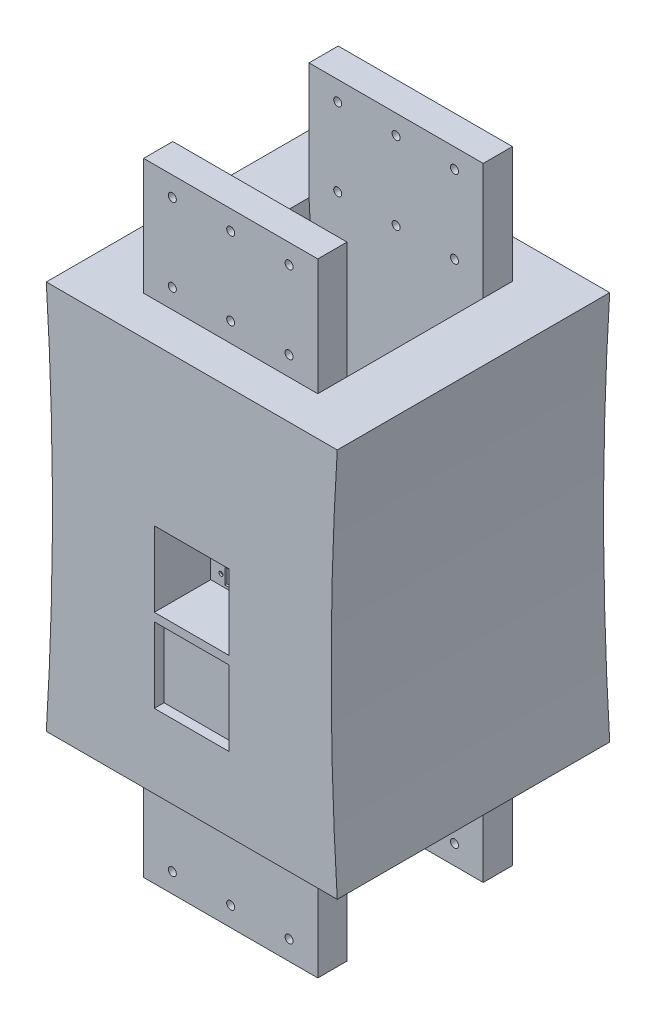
from build123d import *

# Parameters (mm, degrees)
SKETCH_2_W                = 200
SKETCH_2_H                = 113
SKETCH_2_W_2              = 140
SKETCH_2_H_2              = 60
EXTRUDE_2_DEPTH           = 90
SKETCH_4_W                = 200
SKETCH_4_H                = 90
CUT_EXTRUDE_2_DEPTH       = 3
SKETCH_5_R                = 1.5
CUT_EXTRUDE_3_DEPTH       = 222.585198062
SKETCH_6_W                = 200
SKETCH_6_H                = 30
EXTRUDE_4_DEPTH           = 50
EXTRUDE_5_DEPTH           = 140
EXTRUDE_5_2_DEPTH         = 140
CUT_EXTRUDE_4_DEPTH       = 744.370701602
CUT_EXTRUDE_5_DEPTH       = 612.064644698
EXTRUDE_7_DEPTH           = 30
CUT_EXTRUDE_6_DEPTH       = 612.064644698
EXTRUDE_8_DEPTH           = 30
CUT_EXTRUDE_7_DEPTH       = 20
CUT_EXTRUDE_8_DEPTH       = 20
CUT_EXTRUDE_9_DEPTH       = 602.40931708
CUT_EXTRUDE_9_DEPTH_BACK  = 3
SKETCH_17_R               = 5.3
SKETCH_17_R_2             = 2.059176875
SKETCH_19_R               = 2.059176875
CUT_EXTRUDE_10_DEPTH      = 602.40931708
EXTRUDE_9_DEPTH           = 20
CUT_EXTRUDE_11_DEPTH      = 602.40931708
SKETCH_23_R               = 5.3
CUT_EXTRUDE_12_DEPTH      = 3
SKETCH_24_R               = 5.3
CUT_EXTRUDE_13_DEPTH      = 3
SKETCH_25_R               = 5.3
SKETCH_25_R_2             = 2.059176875
EXTRUDE_11_DEPTH          = 3
EXTRUDE_11_2_DEPTH        = 3
EXTRUDE_11_3_DEPTH        = 3
EXTRUDE_11_4_DEPTH        = 3
EXTRUDE_11_5_DEPTH        = 3
EXTRUDE_11_6_DEPTH        = 3
CUT_EXTRUDE_14_DEPTH      = 606.717068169
SKETCH_29_R               = 2.059176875
CUT_EXTRUDE_16_DEPTH      = 20
CUT_EXTRUDE_17_DEPTH      = 605.527066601
CUT_EXTRUDE_17_DEPTH_BACK = 605.527066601
SKETCH_30_R               = 2.059176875
CUT_EXTRUDE_18_DEPTH      = 605.527066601
CUT_EXTRUDE_18_DEPTH_BACK = 20
SKETCH_32_R               = 5.3
CUT_EXTRUDE_19_DEPTH      = 3
SKETCH_33_R               = 5.3
CUT_EXTRUDE_20_DEPTH      = 3
SKETCH_35_W               = 19.25
SKETCH_35_H               = 38.5
CUT_EXTRUDE_21_DEPTH      = 29
SKETCH_36_W               = 38.5
SKETCH_36_H               = 38.5
EXTRUDE_12_DEPTH          = 2
SKETCH_37_R               = 1.05
CUT_EXTRUDE_22_DEPTH      = 3
SKETCH_39_R               = 1.05
CUT_EXTRUDE_23_DEPTH      = 30
SKETCH_40_R               = 5.5
CUT_EXTRUDE_24_DEPTH      = 3
SKETCH_41_R               = 5.5
CUT_EXTRUDE_25_DEPTH      = 3
SKETCH_42_R               = 5.5
CUT_EXTRUDE_26_DEPTH      = 3
SKETCH_43_R               = 5.5
CUT_EXTRUDE_27_DEPTH      = 3
CUT_EXTRUDE_28_DEPTH      = 599.291713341
CUT_EXTRUDE_28_DEPTH_BACK = 599.291713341
CUT_EXTRUDE_29_DEPTH      = 601.210774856
CUT_EXTRUDE_29_DEPTH_BACK = 601.210774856
SKETCH_46_R               = 5.5
SKETCH_46_R_2             = 2.059176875
EXTRUDE_13_DEPTH          = 10
SKETCH_47_R               = 5.5
SKETCH_47_R_2             = 2.059176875
EXTRUDE_14_DEPTH          = 10
EXTRUDE_15_REACH          = 600.292
SKETCH_48_R               = 5.5
SKETCH_48_R_2             = 2.059176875
EXTRUDE_16_REACH          = 600.292
SKETCH_49_R               = 5.5
SKETCH_49_R_2             = 2.059176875
CUT_EXTRUDE_30_DEPTH      = 5
SKETCH_51_R               = 2.059176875
EXTRUDE_17_DEPTH          = 5
SKETCH_52_R               = 2.059176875
EXTRUDE_18_DEPTH          = 5


with BuildPart() as part:
    # Sketch 2 → Extrude 2 (new body)
    with BuildSketch(Plane.XY):
        with Locations((70, 53.5)):
            Rectangle(SKETCH_2_W, SKETCH_2_H)
        with Locations((70, 30)):
            Rectangle(SKETCH_2_W_2, SKETCH_2_H_2, mode=Mode.SUBTRACT)
    extrude(amount=EXTRUDE_2_DEPTH)

    # Sketch 4 → Cut-Extrude 2 (cut)
    with BuildSketch(Plane.XZ.offset(3)):
        with Locations((70, 45)):
            Rectangle(SKETCH_4_W, SKETCH_4_H)
    extrude(amount=-CUT_EXTRUDE_2_DEPTH, mode=Mode.SUBTRACT)

    # Sketch 5 → Cut-Extrude 3 (cut, through all)
    with BuildSketch(Plane(origin=(0, 110, 0), x_dir=(1, 0, 0), z_dir=(0, 1, 0))):
        with Locations(Location((132.5, -7.5, 0), (0, 0, 270))):
            Circle(SKETCH_5_R)
        with Locations(Location((112.5, -7.5, 0), (0, 0, 270))):
            Circle(SKETCH_5_R)
        with Locations(Location((112.5, -17.5, 0), (0, 0, 270))):
            Circle(SKETCH_5_R)
        with Locations(Location((132.5, -17.5, 0), (0, 0, 270))):
            Circle(SKETCH_5_R)
        with Locations(Location((27.5, -7.5, 0), (0, 0, 90))):
            Circle(SKETCH_5_R)
        with Locations(Location((7.5, -7.5, 0), (0, 0, 90))):
            Circle(SKETCH_5_R)
        with Locations(Location((7.5, -17.5, 0), (0, 0, 90))):
            Circle(SKETCH_5_R)
        with Locations(Location((27.5, -17.5, 0), (0, 0, 90))):
            Circle(SKETCH_5_R)
    extrude(amount=-CUT_EXTRUDE_3_DEPTH, mode=Mode.SUBTRACT)

    # Sketch 6 → Extrude 4 (add)
    with BuildSketch(Plane(origin=(0, 0, 0), x_dir=(-1, 0, 0), z_dir=(0, 0, -1))):
        with Locations((-70, 95)):
            Rectangle(SKETCH_6_W, SKETCH_6_H)
    extrude(amount=EXTRUDE_4_DEPTH)

    # Sketch 11 → Cut-Extrude 5 (cut, through all)
    with BuildSketch(Plane.XY.offset(90)):
        Polygon((-30, 110), (-30, 0), (0, 0), (0, 60), (140, 60), (140, 0), (170, 0), (170, 110), align=None)
    extrude(amount=-CUT_EXTRUDE_5_DEPTH, mode=Mode.SUBTRACT)


with BuildPart() as body_2:
    # Sketch 7 → Extrude 5 (new body)
    with BuildSketch(Plane(origin=(0, 0, -50), x_dir=(-1, 0, 0), z_dir=(0, 0, -1))):
        with BuildLine():
            Line((-170, 110), (-140, 110))
            ThreePointArc((-140, 110), (-111.62336455, 410), (-140, 710))
            Line((-140, 710), (-170, 710))
            ThreePointArc((-170, 710), (-141.62336455, 410), (-170, 110))
        make_face()
    extrude(amount=-EXTRUDE_5_DEPTH)


with BuildPart() as body_3:
    # Sketch 7 → Extrude 5 2 (new body)
    with BuildSketch(Plane(origin=(0, 0, -50), x_dir=(-1, 0, 0), z_dir=(0, 0, -1))):
        with BuildLine():
            Line((0, 110), (30, 110))
            ThreePointArc((30, 110), (1.62336455, 410), (30, 710))
            Line((30, 710), (0, 710))
            ThreePointArc((0, 710), (-28.37663545, 410), (0, 110))
        make_face()
    extrude(amount=-EXTRUDE_5_2_DEPTH)


with BuildPart() as cut_extrude_4_tool:
    # Sketch 9 → Cut-Extrude 4 (new, through all)
    with BuildSketch(Plane.XY.offset(90)):
        with BuildLine():
            Line((-9.64346518, 570), (20.35653482, 570))
            ThreePointArc((20.35653482, 570), (11.726376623, 640.225100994), (0, 710))
            Line((0, 710), (-30, 710))
            ThreePointArc((-30, 710), (-18.273623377, 640.225100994), (-9.64346518, 570))
        make_face()
        with BuildLine():
            ThreePointArc((140, 710), (128.273623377, 640.225100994), (119.64346518, 570))
            Line((119.64346518, 570), (149.64346518, 570))
            ThreePointArc((149.64346518, 570), (158.273623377, 640.225100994), (170, 710))
            Line((170, 710), (140, 710))
        make_face()
    extrude(amount=-CUT_EXTRUDE_4_DEPTH)


with BuildPart() as body_2_1:
    add(body_2.part)

    # Cut-Extrude 4: cut by cut_extrude_4_tool
    add(cut_extrude_4_tool.part, mode=Mode.SUBTRACT)



with BuildPart() as body_3_1:
    add(body_3.part)

    # Cut-Extrude 4: cut by cut_extrude_4_tool
    add(cut_extrude_4_tool.part, mode=Mode.SUBTRACT)


with BuildPart() as body_2_2:
    add(body_2_1.part)

    add(body_3_1.part)  # Extrude 7 merges body 3
    # Sketch 12 → Extrude 7 (add)
    with BuildSketch(Plane.XY.offset(90)):
        with BuildLine():
            ThreePointArc((119.64346518, 570), (113.187753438, 339.263890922), (140, 110))
            Line((140, 110), (0, 110))
            ThreePointArc((0, 110), (26.812246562, 339.263890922), (20.35653482, 570))
            Line((20.35653482, 570), (119.64346518, 570))
        make_face()
    extrude(amount=-EXTRUDE_7_DEPTH)

    # Sketch 13 → Cut-Extrude 6 (cut, through all)
    with BuildSketch(Plane.XY.offset(90)):
        with BuildLine():
            Line((25.248577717, 310), (-4.751422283, 310))
            ThreePointArc((-4.751422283, 310), (-14.222776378, 209.601964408), (-30, 110))
            Line((-30, 110), (0, 110))
            ThreePointArc((0, 110), (15.777223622, 209.601964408), (25.248577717, 310))
        make_face()
        with BuildLine():
            ThreePointArc((114.751422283, 310), (124.222776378, 209.601964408), (140, 110))
            Line((140, 110), (170, 110))
            ThreePointArc((170, 110), (154.222776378, 209.601964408), (144.751422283, 310))
            Line((144.751422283, 310), (114.751422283, 310))
        make_face()
    extrude(amount=-CUT_EXTRUDE_6_DEPTH, mode=Mode.SUBTRACT)

    # Sketch 14 → Extrude 8 (add)
    with BuildSketch(Plane(origin=(0, 0, -50), x_dir=(-1, 0, 0), z_dir=(0, 0, -1))):
        with BuildLine():
            ThreePointArc((-20.35653482, 570), (-28.093490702, 440.099551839), (-25.248577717, 310))
            ThreePointArc((-25.248577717, 310), (-15.777223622, 209.601964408), (0, 110))
            Line((0, 110), (-140, 110))
            ThreePointArc((-140, 110), (-124.222776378, 209.601964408), (-114.751422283, 310))
            ThreePointArc((-114.751422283, 310), (-111.906509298, 440.099551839), (-119.64346518, 570))
            Line((-119.64346518, 570), (-20.35653482, 570))
        make_face()
    extrude(amount=-EXTRUDE_8_DEPTH)

    # Sketch 15 → Cut-Extrude 7 (cut)
    with BuildSketch(Plane(origin=(0, 0, -50), x_dir=(-1, 0, 0), z_dir=(0, 0, -1))):
        with BuildLine():
            Line((-114.751422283, 310), (-25.248577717, 310))
            ThreePointArc((-25.248577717, 310), (-15.777223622, 209.601964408), (0, 110))
            Line((0, 110), (-140, 110))
            ThreePointArc((-140, 110), (-124.222776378, 209.601964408), (-114.751422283, 310))
        make_face()
    extrude(amount=-CUT_EXTRUDE_7_DEPTH, mode=Mode.SUBTRACT)

    # Sketch 16 → Cut-Extrude 8 (cut)
    with BuildSketch(Plane.XY.offset(90)):
        with BuildLine():
            Line((0, 110), (140, 110))
            ThreePointArc((140, 110), (124.222776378, 209.601964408), (114.751422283, 310))
            Line((114.751422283, 310), (144.751422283, 310))
            ThreePointArc((144.751422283, 310), (141.906509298, 440.099551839), (149.64346518, 570))
            Line((149.64346518, 570), (-9.64346518, 570))
            ThreePointArc((-9.64346518, 570), (-1.906509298, 440.099551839), (-4.751422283, 310))
            Line((-4.751422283, 310), (25.248577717, 310))
            ThreePointArc((25.248577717, 310), (15.777223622, 209.601964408), (0, 110))
        make_face()
    extrude(amount=-CUT_EXTRUDE_8_DEPTH, mode=Mode.SUBTRACT)

    # Sketch 17 → Cut-Extrude 9 (cut, two sides: drawn at the far end of the back side and taken through both)
    # profile 1 of 6: a face of its own
    with BuildSketch(Plane.XY.offset(70).offset(-CUT_EXTRUDE_9_DEPTH_BACK)):
        with Locations(Location((100, 260, 0), (0, 0, 180))):
            Circle(SKETCH_17_R)
        with Locations(Location((100, 260, 0), (0, 0, 180))):
            Circle(SKETCH_17_R_2, mode=Mode.SUBTRACT)
    # profile 2 of 6: a face of its own
    with BuildSketch(Plane.XY.offset(70).offset(-CUT_EXTRUDE_9_DEPTH_BACK)):
        with Locations(Location((70, 260, 0), (0, 0, 180))):
            Circle(SKETCH_17_R)
        with Locations(Location((70, 260, 0), (0, 0, 180))):
            Circle(SKETCH_17_R_2, mode=Mode.SUBTRACT)
    # profile 3 of 6: a face of its own
    with BuildSketch(Plane.XY.offset(70).offset(-CUT_EXTRUDE_9_DEPTH_BACK)):
        with Locations(Location((40, 260, 0), (0, 0, 180))):
            Circle(SKETCH_17_R)
        with Locations(Location((40, 260, 0), (0, 0, 180))):
            Circle(SKETCH_17_R_2, mode=Mode.SUBTRACT)
    # profile 4 of 6: a face of its own
    with BuildSketch(Plane.XY.offset(70).offset(-CUT_EXTRUDE_9_DEPTH_BACK)):
        with Locations(Location((70, 300, 0), (0, 0, 180))):
            Circle(SKETCH_17_R)
        with Locations(Location((70, 300, 0), (0, 0, 180))):
            Circle(SKETCH_17_R_2, mode=Mode.SUBTRACT)
    # profile 5 of 6: a face of its own
    with BuildSketch(Plane.XY.offset(70).offset(-CUT_EXTRUDE_9_DEPTH_BACK)):
        with Locations(Location((40, 300, 0), (0, 0, 180))):
            Circle(SKETCH_17_R)
        with Locations(Location((40, 300, 0), (0, 0, 180))):
            Circle(SKETCH_17_R_2, mode=Mode.SUBTRACT)
    # profile 6 of 6: a face of its own
    with BuildSketch(Plane.XY.offset(70).offset(-CUT_EXTRUDE_9_DEPTH_BACK)):
        with Locations(Location((100, 300, 0), (0, 0, 180))):
            Circle(SKETCH_17_R)
        with Locations(Location((100, 300, 0), (0, 0, 180))):
            Circle(SKETCH_17_R_2, mode=Mode.SUBTRACT)
    extrude(amount=CUT_EXTRUDE_9_DEPTH + CUT_EXTRUDE_9_DEPTH_BACK, mode=Mode.SUBTRACT)

    # Sketch 19 → Cut-Extrude 10 (cut, through all)
    with BuildSketch(Plane.XY.offset(70)):
        with Locations((40, 300)):
            Circle(SKETCH_19_R)
        with Locations((40, 260)):
            Circle(SKETCH_19_R)
        with Locations((70, 260)):
            Circle(SKETCH_19_R)
        with Locations((70, 300)):
            Circle(SKETCH_19_R)
        with Locations((100, 300)):
            Circle(SKETCH_19_R)
        with Locations((100, 260)):
            Circle(SKETCH_19_R)
    extrude(amount=-CUT_EXTRUDE_10_DEPTH, mode=Mode.SUBTRACT)

    # Sketch 21 → Extrude 9 (add)
    with BuildSketch(Plane.XY.offset(70)):
        with BuildLine():
            Line((25.248577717, 310), (114.751422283, 310))
            Line((114.751422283, 310), (144.751422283, 310))
            ThreePointArc((144.751422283, 310), (141.906509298, 440.099551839), (149.64346518, 570))
            Line((149.64346518, 570), (-9.64346518, 570))
            ThreePointArc((-9.64346518, 570), (-1.906509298, 440.099551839), (-4.751422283, 310))
            Line((-4.751422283, 310), (25.248577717, 310))
        make_face()
    extrude(amount=EXTRUDE_9_DEPTH)

    # Sketch 22 → Cut-Extrude 11 (cut, through all)
    with BuildSketch(Plane(origin=(0, 0, -30), x_dir=(-1, 0, 0), z_dir=(0, 0, -1))):
        with BuildLine():
            Line((-20.35653482, 250), (-76.288101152, 250))
            Line((-76.288101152, 250), (-119.64346518, 250))
            ThreePointArc((-119.64346518, 250), (-128.273623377, 179.774899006), (-140, 110))
            Line((-140, 110), (0, 110))
            ThreePointArc((0, 110), (-11.726376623, 179.774899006), (-20.35653482, 250))
        make_face()
    extrude(amount=-CUT_EXTRUDE_11_DEPTH, mode=Mode.SUBTRACT)

    # Sketch 23 → Cut-Extrude 12 (cut)
    with BuildSketch(Plane.XY.offset(-20)):
        with Locations(Location((70, 300, 0), (0, 0, 180))):
            Circle(SKETCH_23_R)
        with Locations(Location((40, 300, 0), (0, 0, 180))):
            Circle(SKETCH_23_R)
        with Locations(Location((100, 300, 0), (0, 0, 180))):
            Circle(SKETCH_23_R)
        with Locations(Location((40, 260, 0), (0, 0, 180))):
            Circle(SKETCH_23_R)
        with Locations(Location((70, 260, 0), (0, 0, 180))):
            Circle(SKETCH_23_R)
        with Locations(Location((100, 260, 0), (0, 0, 180))):
            Circle(SKETCH_23_R)
    extrude(amount=-CUT_EXTRUDE_12_DEPTH, mode=Mode.SUBTRACT)

    # Sketch 24 → Cut-Extrude 13 (cut)
    with BuildSketch(Plane(origin=(0, 0, 60), x_dir=(-1, 0, 0), z_dir=(0, 0, -1))):
        with Locations((-100, 300)):
            Circle(SKETCH_24_R)
        with Locations((-100, 260)):
            Circle(SKETCH_24_R)
        with Locations((-70, 260)):
            Circle(SKETCH_24_R)
        with Locations((-70, 300)):
            Circle(SKETCH_24_R)
        with Locations((-40, 300)):
            Circle(SKETCH_24_R)
        with Locations((-40, 260)):
            Circle(SKETCH_24_R)
    extrude(amount=-CUT_EXTRUDE_13_DEPTH, mode=Mode.SUBTRACT)

    # Sketch 26 → Cut-Extrude 14 (cut, through all)
    with BuildSketch(Plane.XY.offset(90)):
        with BuildLine():
            Line((-4.751422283, 510), (25.248577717, 510))
            ThreePointArc((25.248577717, 510), (23.084764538, 540.023009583), (20.35653482, 570))
            Line((20.35653482, 570), (-9.64346518, 570))
            ThreePointArc((-9.64346518, 570), (-6.915235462, 540.023009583), (-4.751422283, 510))
        make_face()
        with BuildLine():
            ThreePointArc((119.64346518, 570), (116.915235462, 540.023009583), (114.751422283, 510))
            Line((114.751422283, 510), (144.751422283, 510))
            ThreePointArc((144.751422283, 510), (146.915235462, 540.023009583), (149.64346518, 570))
            Line((149.64346518, 570), (119.64346518, 570))
        make_face()
    extrude(amount=-CUT_EXTRUDE_14_DEPTH, mode=Mode.SUBTRACT)

    # Sketch 29 → Cut-Extrude 16 (cut)
    with BuildSketch(Plane(origin=(0, 0, -50), x_dir=(-1, 0, 0), z_dir=(0, 0, -1))):
        with BuildLine():
            Line((-114.751422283, 510), (-25.248577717, 510))
            ThreePointArc((-25.248577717, 510), (-23.084764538, 540.023009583), (-20.35653482, 570))
            Line((-20.35653482, 570), (-119.64346518, 570))
            ThreePointArc((-119.64346518, 570), (-116.915235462, 540.023009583), (-114.751422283, 510))
        make_face()
        with Locations((-40, 560)):
            Circle(SKETCH_29_R, mode=Mode.SUBTRACT)
        with Locations((-100, 560)):
            Circle(SKETCH_29_R, mode=Mode.SUBTRACT)
        with Locations((-70, 520)):
            Circle(SKETCH_29_R, mode=Mode.SUBTRACT)
        with Locations((-100, 520)):
            Circle(SKETCH_29_R, mode=Mode.SUBTRACT)
        with Locations((-70, 560)):
            Circle(SKETCH_29_R, mode=Mode.SUBTRACT)
        with Locations((-40, 520)):
            Circle(SKETCH_29_R, mode=Mode.SUBTRACT)
    extrude(amount=-CUT_EXTRUDE_16_DEPTH, mode=Mode.SUBTRACT)

    # Sketch 30 → Cut-Extrude 17 (cut, two sides: drawn at the far end of the back side and taken through both)
    with BuildSketch(Plane(origin=(0, 0, -50), x_dir=(-1, 0, 0), z_dir=(0, 0, -1)).offset(-CUT_EXTRUDE_17_DEPTH_BACK)):
        with Locations((-100, 520)):
            Circle(SKETCH_30_R)
        with Locations((-100, 560)):
            Circle(SKETCH_30_R)
        with Locations((-70, 560)):
            Circle(SKETCH_30_R)
        with Locations((-70, 520)):
            Circle(SKETCH_30_R)
        with Locations((-40, 560)):
            Circle(SKETCH_30_R)
        with Locations((-40, 520)):
            Circle(SKETCH_30_R)
    extrude(amount=CUT_EXTRUDE_17_DEPTH + CUT_EXTRUDE_17_DEPTH_BACK, mode=Mode.SUBTRACT)

    # Sketch 31 → Cut-Extrude 18 (cut, two sides: drawn at the far end of the back side and taken through both)
    with BuildSketch(Plane.XY.offset(90).offset(-CUT_EXTRUDE_18_DEPTH_BACK)):
        with BuildLine():
            Line((25.248577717, 510), (114.751422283, 510))
            ThreePointArc((114.751422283, 510), (116.915235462, 540.023009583), (119.64346518, 570))
            Line((119.64346518, 570), (20.35653482, 570))
            ThreePointArc((20.35653482, 570), (23.084764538, 540.023009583), (25.248577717, 510))
        make_face()
    extrude(amount=CUT_EXTRUDE_18_DEPTH + CUT_EXTRUDE_18_DEPTH_BACK, mode=Mode.SUBTRACT)

    # Sketch 32 → Cut-Extrude 19 (cut)
    with BuildSketch(Plane.XY.offset(-20)):
        with Locations((40, 300)):
            Circle(SKETCH_32_R)
        with Locations(Location((70, 260, 0), (0, 0, 180))):
            Circle(SKETCH_32_R)
        with Locations(Location((100, 260, 0), (0, 0, 180))):
            Circle(SKETCH_32_R)
        with Locations(Location((100, 300, 0), (0, 0, 180))):
            Circle(SKETCH_32_R)
        with Locations(Location((70, 300, 0), (0, 0, 180))):
            Circle(SKETCH_32_R)
        with Locations(Location((40, 260, 0), (0, 0, 180))):
            Circle(SKETCH_32_R)
        with Locations(Location((100, 560, 0), (0, 0, 180))):
            Circle(SKETCH_32_R)
        with Locations(Location((70, 560, 0), (0, 0, 180))):
            Circle(SKETCH_32_R)
        with Locations(Location((40, 560, 0), (0, 0, 180))):
            Circle(SKETCH_32_R)
        with Locations(Location((40, 520, 0), (0, 0, 180))):
            Circle(SKETCH_32_R)
        with Locations(Location((100, 520, 0), (0, 0, 180))):
            Circle(SKETCH_32_R)
        with Locations(Location((70, 520, 0), (0, 0, 180))):
            Circle(SKETCH_32_R)
    extrude(amount=-CUT_EXTRUDE_19_DEPTH, mode=Mode.SUBTRACT)

    # Sketch 33 → Cut-Extrude 20 (cut)
    with BuildSketch(Plane(origin=(0, 0, 60), x_dir=(-1, 0, 0), z_dir=(0, 0, -1))):
        with Locations((-100, 560)):
            Circle(SKETCH_33_R)
        with Locations((-100, 520)):
            Circle(SKETCH_33_R)
        with Locations((-70, 520)):
            Circle(SKETCH_33_R)
        with Locations((-40, 520)):
            Circle(SKETCH_33_R)
        with Locations((-40, 560)):
            Circle(SKETCH_33_R)
        with Locations((-70, 560)):
            Circle(SKETCH_33_R)
    extrude(amount=-CUT_EXTRUDE_20_DEPTH, mode=Mode.SUBTRACT)

    # Sketch 35 → Cut-Extrude 21 (cut)
    with BuildSketch(Plane.XY.offset(90)):
        with Locations((60.375, 410)):
            Rectangle(SKETCH_35_W, SKETCH_35_H)
        with Locations((79.625, 410)):
            Rectangle(SKETCH_35_W, SKETCH_35_H)
    extrude(amount=-CUT_EXTRUDE_21_DEPTH, mode=Mode.SUBTRACT)

    # Sketch 36 → Extrude 12 (add)
    with BuildSketch(Plane.XY.offset(61)):
        with Locations((70, 410)):
            Rectangle(SKETCH_36_W, SKETCH_36_H)
    extrude(amount=-EXTRUDE_12_DEPTH)

    # Sketch 37 → Cut-Extrude 22 (cut)
    with BuildSketch(Plane.XY.offset(61)):
        with Locations((84, 424)):
            Circle(SKETCH_37_R)
        with Locations((84, 396)):
            Circle(SKETCH_37_R)
        with Locations((56, 396)):
            Circle(SKETCH_37_R)
        with Locations((56, 424)):
            Circle(SKETCH_37_R)
    extrude(amount=-CUT_EXTRUDE_22_DEPTH, mode=Mode.SUBTRACT)

    # Sketch 39 → Cut-Extrude 23 (cut)
    with BuildSketch(Plane.XY.offset(61)):
        Polygon((58, 400), (70, 400), (70, 392), (58, 392), (58, 396), align=None)
        Polygon((70, 392), (82, 392), (82, 396), (82, 400), (70, 400), align=None)
        Polygon((58, 420), (70, 420), (70, 428), (58, 428), (58, 424), align=None)
        Polygon((82, 420), (82, 424), (82, 428), (70, 428), (70, 420), align=None)
        with Locations((56, 424)):
            Circle(SKETCH_39_R)
        with Locations((56, 396)):
            Circle(SKETCH_39_R)
        with Locations((84, 396)):
            Circle(SKETCH_39_R)
        with Locations((84, 424)):
            Circle(SKETCH_39_R)
    extrude(amount=-CUT_EXTRUDE_23_DEPTH, mode=Mode.SUBTRACT)

    # Sketch 40 → Cut-Extrude 24 (cut)
    with BuildSketch(Plane(origin=(0, 0, 60), x_dir=(-1, 0, 0), z_dir=(0, 0, -1))):
        with Locations((-100, 560)):
            Circle(SKETCH_40_R)
        with Locations((-70, 560)):
            Circle(SKETCH_40_R)
        with Locations((-40, 560)):
            Circle(SKETCH_40_R)
        with Locations((-70, 520)):
            Circle(SKETCH_40_R)
        with Locations((-40, 520)):
            Circle(SKETCH_40_R)
        with Locations((-100, 520)):
            Circle(SKETCH_40_R)
    extrude(amount=-CUT_EXTRUDE_24_DEPTH, mode=Mode.SUBTRACT)

    # Sketch 41 → Cut-Extrude 25 (cut)
    with BuildSketch(Plane.XY.offset(-20)):
        with Locations(Location((100, 560, 0), (0, 0, 180))):
            Circle(SKETCH_41_R)
        with Locations(Location((40, 560, 0), (0, 0, 180))):
            Circle(SKETCH_41_R)
        with Locations(Location((70, 560, 0), (0, 0, 180))):
            Circle(SKETCH_41_R)
        with Locations(Location((40, 520, 0), (0, 0, 180))):
            Circle(SKETCH_41_R)
        with Locations(Location((70, 520, 0), (0, 0, 180))):
            Circle(SKETCH_41_R)
        with Locations(Location((100, 520, 0), (0, 0, 180))):
            Circle(SKETCH_41_R)
    extrude(amount=-CUT_EXTRUDE_25_DEPTH, mode=Mode.SUBTRACT)

    # Sketch 42 → Cut-Extrude 26 (cut)
    with BuildSketch(Plane(origin=(0, 0, 60), x_dir=(-1, 0, 0), z_dir=(0, 0, -1))):
        with Locations(Location((-40, 300, 0), (0, 0, 180))):
            Circle(SKETCH_42_R)
        with Locations(Location((-70, 300, 0), (0, 0, 180))):
            Circle(SKETCH_42_R)
        with Locations(Location((-100, 300, 0), (0, 0, 180))):
            Circle(SKETCH_42_R)
        with Locations(Location((-100, 260, 0), (0, 0, 180))):
            Circle(SKETCH_42_R)
        with Locations(Location((-70, 260, 0), (0, 0, 180))):
            Circle(SKETCH_42_R)
        with Locations(Location((-40, 260, 0), (0, 0, 180))):
            Circle(SKETCH_42_R)
    extrude(amount=-CUT_EXTRUDE_26_DEPTH, mode=Mode.SUBTRACT)

    # Sketch 43 → Cut-Extrude 27 (cut)
    with BuildSketch(Plane.XY.offset(-20)):
        with Locations((100, 300)):
            Circle(SKETCH_43_R)
        with Locations((100, 260)):
            Circle(SKETCH_43_R)
        with Locations((70, 260)):
            Circle(SKETCH_43_R)
        with Locations((40, 260)):
            Circle(SKETCH_43_R)
        with Locations((40, 300)):
            Circle(SKETCH_43_R)
        with Locations((70, 300)):
            Circle(SKETCH_43_R)
    extrude(amount=-CUT_EXTRUDE_27_DEPTH, mode=Mode.SUBTRACT)

    # Sketch 44 → Cut-Extrude 28 (cut, two sides: drawn at the far end of the back side and taken through both)
    with BuildSketch(Plane.XY.offset(-20).offset(-CUT_EXTRUDE_28_DEPTH_BACK)):
        with BuildLine():
            ThreePointArc((20.35653482, 570), (23.084764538, 540.023009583), (25.248577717, 510))
            Line((25.248577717, 510), (25.248577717, 570))
            Line((25.248577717, 570), (20.35653482, 570))
        make_face()
        with BuildLine():
            Line((119.64346518, 570), (114.751422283, 570))
            Line((114.751422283, 570), (114.751422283, 510))
            ThreePointArc((114.751422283, 510), (116.915235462, 540.023009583), (119.64346518, 570))
        make_face()
    extrude(amount=CUT_EXTRUDE_28_DEPTH + CUT_EXTRUDE_28_DEPTH_BACK, mode=Mode.SUBTRACT)

    # Sketch 45 → Cut-Extrude 29 (cut, two sides: drawn at the far end of the back side and taken through both)
    with BuildSketch(Plane.XY.offset(70).offset(-CUT_EXTRUDE_29_DEPTH_BACK)):
        with BuildLine():
            Line((25.248577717, 250), (25.248577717, 310))
            ThreePointArc((25.248577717, 310), (23.084764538, 279.976990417), (20.35653482, 250))
            Line((20.35653482, 250), (25.248577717, 250))
        make_face()
        with BuildLine():
            ThreePointArc((119.64346518, 250), (116.915235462, 279.976990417), (114.751422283, 310))
            Line((114.751422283, 310), (114.751422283, 250))
            Line((114.751422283, 250), (119.64346518, 250))
        make_face()
    extrude(amount=CUT_EXTRUDE_29_DEPTH + CUT_EXTRUDE_29_DEPTH_BACK, mode=Mode.SUBTRACT)



with BuildPart() as body_2_2_1:
    # Sketch 25 → Extrude 11 (new body)
    with BuildSketch(Plane.XY.offset(70)):
        with Locations((40, 300)):
            Circle(SKETCH_25_R)
        with Locations((40, 300)):
            Circle(SKETCH_25_R_2, mode=Mode.SUBTRACT)
    extrude(amount=-EXTRUDE_11_DEPTH)


with BuildPart() as body_3_2:
    # Sketch 25 → Extrude 11 2 (new body)
    with BuildSketch(Plane.XY.offset(70)):
        with Locations(Location((70, 300, 0), (0, 0, 180))):
            Circle(SKETCH_25_R)
        with Locations((70, 300)):
            Circle(SKETCH_25_R_2, mode=Mode.SUBTRACT)
    extrude(amount=-EXTRUDE_11_2_DEPTH)


with BuildPart() as body_4:
    # Sketch 25 → Extrude 11 3 (new body)
    with BuildSketch(Plane.XY.offset(70)):
        with Locations(Location((100, 300, 0), (0, 0, 180))):
            Circle(SKETCH_25_R)
        with Locations((100, 300)):
            Circle(SKETCH_25_R_2, mode=Mode.SUBTRACT)
    extrude(amount=-EXTRUDE_11_3_DEPTH)


with BuildPart() as body_5:
    # Sketch 25 → Extrude 11 4 (new body)
    with BuildSketch(Plane.XY.offset(70)):
        with Locations(Location((40, 260, 0), (0, 0, 180))):
            Circle(SKETCH_25_R)
        with Locations((40, 260)):
            Circle(SKETCH_25_R_2, mode=Mode.SUBTRACT)
    extrude(amount=-EXTRUDE_11_4_DEPTH)


with BuildPart() as body_6:
    # Sketch 25 → Extrude 11 5 (new body)
    with BuildSketch(Plane.XY.offset(70)):
        with Locations(Location((70, 260, 0), (0, 0, 180))):
            Circle(SKETCH_25_R)
        with Locations((70, 260)):
            Circle(SKETCH_25_R_2, mode=Mode.SUBTRACT)
    extrude(amount=-EXTRUDE_11_5_DEPTH)


with BuildPart() as body_7:
    # Sketch 25 → Extrude 11 6 (new body)
    with BuildSketch(Plane.XY.offset(70)):
        with Locations(Location((100, 260, 0), (0, 0, 180))):
            Circle(SKETCH_25_R)
        with Locations((100, 260)):
            Circle(SKETCH_25_R_2, mode=Mode.SUBTRACT)
    extrude(amount=-EXTRUDE_11_6_DEPTH)


with BuildPart() as body_2_3:
    add(body_2_2.part)

    add(body_2_2_1.part)  # Extrude 13 merges body 2 2

    add(body_3_2.part)  # Extrude 13 merges body 3 2

    add(body_4.part)  # Extrude 13 merges body 4

    add(body_5.part)  # Extrude 13 merges body 5

    add(body_6.part)  # Extrude 13 merges body 6

    add(body_7.part)  # Extrude 13 merges body 7
    # Sketch 46 → Extrude 13 (add)
    # profile 1 of 6: a face of its own
    with BuildSketch(Plane(origin=(0, 0, 60), x_dir=(-1, 0, 0), z_dir=(0, 0, -1))):
        with Locations((-100, 300)):
            Circle(SKETCH_46_R)
        with Locations(Location((-100, 300, 0), (0, 0, 180))):
            Circle(SKETCH_46_R_2, mode=Mode.SUBTRACT)
    # profile 2 of 6: a face of its own
    with BuildSketch(Plane(origin=(0, 0, 60), x_dir=(-1, 0, 0), z_dir=(0, 0, -1))):
        with Locations((-100, 260)):
            Circle(SKETCH_46_R)
        with Locations(Location((-100, 260, 0), (0, 0, 180))):
            Circle(SKETCH_46_R_2, mode=Mode.SUBTRACT)
    # profile 3 of 6: a face of its own
    with BuildSketch(Plane(origin=(0, 0, 60), x_dir=(-1, 0, 0), z_dir=(0, 0, -1))):
        with Locations((-70, 300)):
            Circle(SKETCH_46_R)
        with Locations(Location((-70, 300, 0), (0, 0, 180))):
            Circle(SKETCH_46_R_2, mode=Mode.SUBTRACT)
    # profile 4 of 6: a face of its own
    with BuildSketch(Plane(origin=(0, 0, 60), x_dir=(-1, 0, 0), z_dir=(0, 0, -1))):
        with Locations((-70, 260)):
            Circle(SKETCH_46_R)
        with Locations(Location((-70, 260, 0), (0, 0, 180))):
            Circle(SKETCH_46_R_2, mode=Mode.SUBTRACT)
    # profile 5 of 6: a face of its own
    with BuildSketch(Plane(origin=(0, 0, 60), x_dir=(-1, 0, 0), z_dir=(0, 0, -1))):
        with Locations((-40, 300)):
            Circle(SKETCH_46_R)
        with Locations(Location((-40, 300, 0), (0, 0, 180))):
            Circle(SKETCH_46_R_2, mode=Mode.SUBTRACT)
    # profile 6 of 6: a face of its own
    with BuildSketch(Plane(origin=(0, 0, 60), x_dir=(-1, 0, 0), z_dir=(0, 0, -1))):
        with Locations((-40, 260)):
            Circle(SKETCH_46_R)
        with Locations(Location((-40, 260, 0), (0, 0, 180))):
            Circle(SKETCH_46_R_2, mode=Mode.SUBTRACT)
    extrude(amount=-EXTRUDE_13_DEPTH)

    # Sketch 47 → Extrude 14 (add)
    # profile 1 of 6: a face of its own
    with BuildSketch(Plane.XY.offset(-20)):
        with Locations((100, 260)):
            Circle(SKETCH_47_R)
        with Locations((100, 260)):
            Circle(SKETCH_47_R_2, mode=Mode.SUBTRACT)
    # profile 2 of 6: a face of its own
    with BuildSketch(Plane.XY.offset(-20)):
        with Locations((70, 260)):
            Circle(SKETCH_47_R)
        with Locations((70, 260)):
            Circle(SKETCH_47_R_2, mode=Mode.SUBTRACT)
    # profile 3 of 6: a face of its own
    with BuildSketch(Plane.XY.offset(-20)):
        with Locations((40, 260)):
            Circle(SKETCH_47_R)
        with Locations((40, 260)):
            Circle(SKETCH_47_R_2, mode=Mode.SUBTRACT)
    # profile 4 of 6: a face of its own
    with BuildSketch(Plane.XY.offset(-20)):
        with Locations((100, 300)):
            Circle(SKETCH_47_R)
        with Locations((100, 300)):
            Circle(SKETCH_47_R_2, mode=Mode.SUBTRACT)
    # profile 5 of 6: a face of its own
    with BuildSketch(Plane.XY.offset(-20)):
        with Locations((40, 300)):
            Circle(SKETCH_47_R)
        with Locations((40, 300)):
            Circle(SKETCH_47_R_2, mode=Mode.SUBTRACT)
    # profile 6 of 6: a face of its own
    with BuildSketch(Plane.XY.offset(-20)):
        with Locations((70, 300)):
            Circle(SKETCH_47_R)
        with Locations((70, 300)):
            Circle(SKETCH_47_R_2, mode=Mode.SUBTRACT)
    extrude(amount=-EXTRUDE_14_DEPTH)

    # Sketch 48 → Extrude 15 (add, up to next)
    with BuildSketch(Plane.XY.offset(-20), mode=Mode.PRIVATE) as extrude_15_sk1:
        with Locations(Location((40, 560, 0), (0, 0, 180))):
            Circle(SKETCH_48_R)
        with Locations(Location((40, 560, 0), (0, 0, 180))):
            Circle(SKETCH_48_R_2, mode=Mode.SUBTRACT)
    extrude_15_tool1 = extrude(extrude_15_sk1.sketch, amount=-EXTRUDE_15_REACH, mode=Mode.PRIVATE) - body_2_3.part
    # Sketch 48 → Extrude 15 (add, up to next)
    with BuildSketch(Plane.XY.offset(-20), mode=Mode.PRIVATE) as extrude_15_sk2:
        with Locations(Location((70, 560, 0), (0, 0, 180))):
            Circle(SKETCH_48_R)
        with Locations(Location((70, 560, 0), (0, 0, 180))):
            Circle(SKETCH_48_R_2, mode=Mode.SUBTRACT)
    extrude_15_tool2 = extrude(extrude_15_sk2.sketch, amount=-EXTRUDE_15_REACH, mode=Mode.PRIVATE) - body_2_3.part
    # Sketch 48 → Extrude 15 (add, up to next)
    with BuildSketch(Plane.XY.offset(-20), mode=Mode.PRIVATE) as extrude_15_sk3:
        with Locations(Location((100, 560, 0), (0, 0, 180))):
            Circle(SKETCH_48_R)
        with Locations(Location((100, 560, 0), (0, 0, 180))):
            Circle(SKETCH_48_R_2, mode=Mode.SUBTRACT)
    extrude_15_tool3 = extrude(extrude_15_sk3.sketch, amount=-EXTRUDE_15_REACH, mode=Mode.PRIVATE) - body_2_3.part
    # Sketch 48 → Extrude 15 (add, up to next)
    with BuildSketch(Plane.XY.offset(-20), mode=Mode.PRIVATE) as extrude_15_sk4:
        with Locations(Location((40, 520, 0), (0, 0, 180))):
            Circle(SKETCH_48_R)
        with Locations(Location((40, 520, 0), (0, 0, 180))):
            Circle(SKETCH_48_R_2, mode=Mode.SUBTRACT)
    extrude_15_tool4 = extrude(extrude_15_sk4.sketch, amount=-EXTRUDE_15_REACH, mode=Mode.PRIVATE) - body_2_3.part
    # Sketch 48 → Extrude 15 (add, up to next)
    with BuildSketch(Plane.XY.offset(-20), mode=Mode.PRIVATE) as extrude_15_sk5:
        with Locations(Location((70, 520, 0), (0, 0, 180))):
            Circle(SKETCH_48_R)
        with Locations(Location((70, 520, 0), (0, 0, 180))):
            Circle(SKETCH_48_R_2, mode=Mode.SUBTRACT)
    extrude_15_tool5 = extrude(extrude_15_sk5.sketch, amount=-EXTRUDE_15_REACH, mode=Mode.PRIVATE) - body_2_3.part
    # Sketch 48 → Extrude 15 (add, up to next)
    with BuildSketch(Plane.XY.offset(-20), mode=Mode.PRIVATE) as extrude_15_sk6:
        with Locations(Location((100, 520, 0), (0, 0, 180))):
            Circle(SKETCH_48_R)
        with Locations(Location((100, 520, 0), (0, 0, 180))):
            Circle(SKETCH_48_R_2, mode=Mode.SUBTRACT)
    extrude_15_tool6 = extrude(extrude_15_sk6.sketch, amount=-EXTRUDE_15_REACH, mode=Mode.PRIVATE) - body_2_3.part
    add(extrude_15_tool1.solids().sort_by_distance((45.344437, 560, -20))[0])
    add(extrude_15_tool2.solids().sort_by_distance((75.344437, 560, -20))[0])
    add(extrude_15_tool3.solids().sort_by_distance((105.344437, 560, -20))[0])
    add(extrude_15_tool4.solids().sort_by_distance((45.344437, 520, -20))[0])
    add(extrude_15_tool5.solids().sort_by_distance((75.344437, 520, -20))[0])
    add(extrude_15_tool6.solids().sort_by_distance((105.344437, 520, -20))[0])

    # Sketch 49 → Extrude 16 (add, up to next)
    with BuildSketch(Plane(origin=(0, 0, 60), x_dir=(-1, 0, 0), z_dir=(0, 0, -1)), mode=Mode.PRIVATE) as extrude_16_sk1:
        with Locations((-100, 560)):
            Circle(SKETCH_49_R)
        with Locations((-100, 560)):
            Circle(SKETCH_49_R_2, mode=Mode.SUBTRACT)
    extrude_16_tool1 = extrude(extrude_16_sk1.sketch, amount=-EXTRUDE_16_REACH, mode=Mode.PRIVATE) - body_2_3.part
    # Sketch 49 → Extrude 16 (add, up to next)
    with BuildSketch(Plane(origin=(0, 0, 60), x_dir=(-1, 0, 0), z_dir=(0, 0, -1)), mode=Mode.PRIVATE) as extrude_16_sk2:
        with Locations((-40, 520)):
            Circle(SKETCH_49_R)
        with Locations((-40, 520)):
            Circle(SKETCH_49_R_2, mode=Mode.SUBTRACT)
    extrude_16_tool2 = extrude(extrude_16_sk2.sketch, amount=-EXTRUDE_16_REACH, mode=Mode.PRIVATE) - body_2_3.part
    # Sketch 49 → Extrude 16 (add, up to next)
    with BuildSketch(Plane(origin=(0, 0, 60), x_dir=(-1, 0, 0), z_dir=(0, 0, -1)), mode=Mode.PRIVATE) as extrude_16_sk3:
        with Locations((-70, 520)):
            Circle(SKETCH_49_R)
        with Locations((-70, 520)):
            Circle(SKETCH_49_R_2, mode=Mode.SUBTRACT)
    extrude_16_tool3 = extrude(extrude_16_sk3.sketch, amount=-EXTRUDE_16_REACH, mode=Mode.PRIVATE) - body_2_3.part
    # Sketch 49 → Extrude 16 (add, up to next)
    with BuildSketch(Plane(origin=(0, 0, 60), x_dir=(-1, 0, 0), z_dir=(0, 0, -1)), mode=Mode.PRIVATE) as extrude_16_sk4:
        with Locations((-100, 520)):
            Circle(SKETCH_49_R)
        with Locations((-100, 520)):
            Circle(SKETCH_49_R_2, mode=Mode.SUBTRACT)
    extrude_16_tool4 = extrude(extrude_16_sk4.sketch, amount=-EXTRUDE_16_REACH, mode=Mode.PRIVATE) - body_2_3.part
    # Sketch 49 → Extrude 16 (add, up to next)
    with BuildSketch(Plane(origin=(0, 0, 60), x_dir=(-1, 0, 0), z_dir=(0, 0, -1)), mode=Mode.PRIVATE) as extrude_16_sk5:
        with Locations((-40, 560)):
            Circle(SKETCH_49_R)
        with Locations((-40, 560)):
            Circle(SKETCH_49_R_2, mode=Mode.SUBTRACT)
    extrude_16_tool5 = extrude(extrude_16_sk5.sketch, amount=-EXTRUDE_16_REACH, mode=Mode.PRIVATE) - body_2_3.part
    # Sketch 49 → Extrude 16 (add, up to next)
    with BuildSketch(Plane(origin=(0, 0, 60), x_dir=(-1, 0, 0), z_dir=(0, 0, -1)), mode=Mode.PRIVATE) as extrude_16_sk6:
        with Locations((-70, 560)):
            Circle(SKETCH_49_R)
        with Locations((-70, 560)):
            Circle(SKETCH_49_R_2, mode=Mode.SUBTRACT)
    extrude_16_tool6 = extrude(extrude_16_sk6.sketch, amount=-EXTRUDE_16_REACH, mode=Mode.PRIVATE) - body_2_3.part
    add(extrude_16_tool1.solids().sort_by_distance((105.344437, 560, 60))[0])
    add(extrude_16_tool2.solids().sort_by_distance((45.344437, 520, 60))[0])
    add(extrude_16_tool3.solids().sort_by_distance((75.344437, 520, 60))[0])
    add(extrude_16_tool4.solids().sort_by_distance((105.344437, 520, 60))[0])
    add(extrude_16_tool5.solids().sort_by_distance((45.344437, 560, 60))[0])
    add(extrude_16_tool6.solids().sort_by_distance((75.344437, 560, 60))[0])

    # Sketch 50 → Cut-Extrude 30 (cut)
    with BuildSketch(Plane.XY.offset(90)):
        Polygon((89.25, 386.5), (89.25, 348), (70, 348), (50.75, 348), (50.75, 386.5), align=None)
    extrude(amount=-CUT_EXTRUDE_30_DEPTH, mode=Mode.SUBTRACT)

    # Sketch 51 → Extrude 17 (add)
    with BuildSketch(Plane(origin=(0, 0, 60), x_dir=(-1, 0, 0), z_dir=(0, 0, -1))):
        with BuildLine():
            Line((-25.248577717, 250), (-25.248577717, 310))
            ThreePointArc((-25.248577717, 310), (-28.37663545, 410), (-25.248577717, 510))
            Line((-25.248577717, 510), (-25.248577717, 570))
            Line((-25.248577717, 570), (-114.751422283, 570))
            Line((-114.751422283, 570), (-114.751422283, 510))
            ThreePointArc((-114.751422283, 510), (-111.62336455, 410), (-114.751422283, 310))
            Line((-114.751422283, 310), (-114.751422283, 250))
            Line((-114.751422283, 250), (-25.248577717, 250))
        make_face()
        with Locations(Location((-40, 260, 0), (0, 0, 180))):
            Circle(SKETCH_51_R, mode=Mode.SUBTRACT)
        with Locations(Location((-40, 300, 0), (0, 0, 180))):
            Circle(SKETCH_51_R, mode=Mode.SUBTRACT)
        with Locations(Location((-70, 300, 0), (0, 0, 180))):
            Circle(SKETCH_51_R, mode=Mode.SUBTRACT)
        with Locations(Location((-70, 260, 0), (0, 0, 180))):
            Circle(SKETCH_51_R, mode=Mode.SUBTRACT)
        with Locations(Location((-100, 260, 0), (0, 0, 180))):
            Circle(SKETCH_51_R, mode=Mode.SUBTRACT)
        with Locations(Location((-100, 300, 0), (0, 0, 180))):
            Circle(SKETCH_51_R, mode=Mode.SUBTRACT)
        with Locations((-40, 520)):
            Circle(SKETCH_51_R, mode=Mode.SUBTRACT)
        with Locations((-70, 520)):
            Circle(SKETCH_51_R, mode=Mode.SUBTRACT)
        with Locations((-100, 520)):
            Circle(SKETCH_51_R, mode=Mode.SUBTRACT)
        with Locations((-100, 560)):
            Circle(SKETCH_51_R, mode=Mode.SUBTRACT)
        with Locations((-70, 560)):
            Circle(SKETCH_51_R, mode=Mode.SUBTRACT)
        with Locations((-40, 560)):
            Circle(SKETCH_51_R, mode=Mode.SUBTRACT)
    extrude(amount=EXTRUDE_17_DEPTH)

    # Sketch 52 → Extrude 18 (add)
    with BuildSketch(Plane.XY.offset(-20)):
        with BuildLine():
            Line((25.248577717, 310), (25.248577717, 250))
            Line((25.248577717, 250), (114.751422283, 250))
            Line((114.751422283, 250), (114.751422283, 310))
            ThreePointArc((114.751422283, 310), (111.62336455, 410), (114.751422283, 510))
            Line((114.751422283, 510), (114.751422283, 570))
            Line((114.751422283, 570), (25.248577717, 570))
            Line((25.248577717, 570), (25.248577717, 510))
            ThreePointArc((25.248577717, 510), (28.37663545, 410), (25.248577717, 310))
        make_face()
        with Locations((100, 260)):
            Circle(SKETCH_52_R, mode=Mode.SUBTRACT)
        with Locations((100, 300)):
            Circle(SKETCH_52_R, mode=Mode.SUBTRACT)
        with Locations((70, 300)):
            Circle(SKETCH_52_R, mode=Mode.SUBTRACT)
        with Locations((70, 260)):
            Circle(SKETCH_52_R, mode=Mode.SUBTRACT)
        with Locations((40, 260)):
            Circle(SKETCH_52_R, mode=Mode.SUBTRACT)
        with Locations((40, 300)):
            Circle(SKETCH_52_R, mode=Mode.SUBTRACT)
        with Locations(Location((40, 520, 0), (0, 0, 180))):
            Circle(SKETCH_52_R, mode=Mode.SUBTRACT)
        with Locations(Location((70, 520, 0), (0, 0, 180))):
            Circle(SKETCH_52_R, mode=Mode.SUBTRACT)
        with Locations(Location((100, 520, 0), (0, 0, 180))):
            Circle(SKETCH_52_R, mode=Mode.SUBTRACT)
        with Locations(Location((100, 560, 0), (0, 0, 180))):
            Circle(SKETCH_52_R, mode=Mode.SUBTRACT)
        with Locations(Location((70, 560, 0), (0, 0, 180))):
            Circle(SKETCH_52_R, mode=Mode.SUBTRACT)
        with Locations(Location((40, 560, 0), (0, 0, 180))):
            Circle(SKETCH_52_R, mode=Mode.SUBTRACT)
    extrude(amount=EXTRUDE_18_DEPTH)


solid = body_2_3.part
